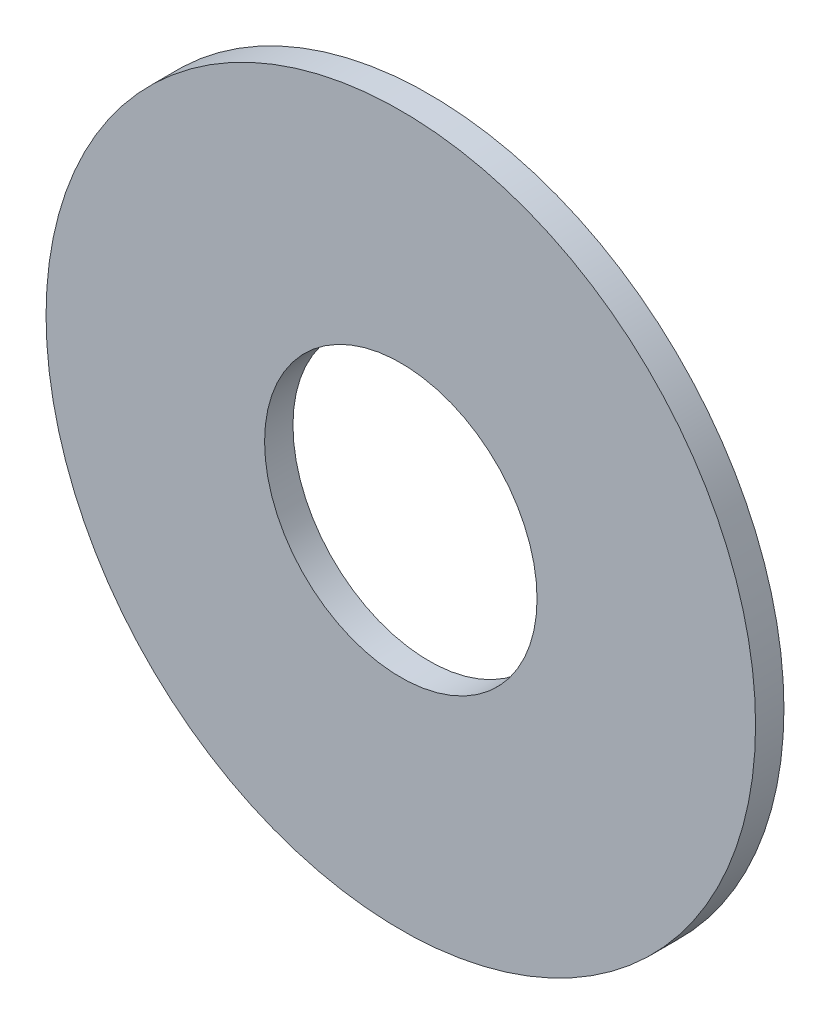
ISO-10303-21;
HEADER;
FILE_DESCRIPTION(('STEP AP214'),'2;1');
FILE_NAME('part.step','',(''),(''),'','','');
FILE_SCHEMA(('AUTOMOTIVE_DESIGN { 1 0 10303 214 1 1 1 1 }'));
ENDSEC;
DATA;
#1=APPLICATION_CONTEXT('core data for automotive mechanical design processes');
#2=APPLICATION_PROTOCOL_DEFINITION('international standard','automotive_design',2000,#1);
#3=PRODUCT_CONTEXT('',#1,'mechanical');
#4=PRODUCT('Part','Part','',(#3));
#5=PRODUCT_RELATED_PRODUCT_CATEGORY('part','',(#4));
#6=PRODUCT_DEFINITION_FORMATION('','',#4);
#7=PRODUCT_DEFINITION_CONTEXT('part definition',#1,'design');
#8=PRODUCT_DEFINITION('design','',#6,#7);
#9=PRODUCT_DEFINITION_SHAPE('','',#8);
#10=(LENGTH_UNIT() NAMED_UNIT(*) SI_UNIT(.MILLI.,.METRE.));
#11=(NAMED_UNIT(*) PLANE_ANGLE_UNIT() SI_UNIT($,.RADIAN.));
#12=(NAMED_UNIT(*) SI_UNIT($,.STERADIAN.) SOLID_ANGLE_UNIT());
#13=UNCERTAINTY_MEASURE_WITH_UNIT(LENGTH_MEASURE(1.E-05),#10,'distance_accuracy_value','');
#14=(GEOMETRIC_REPRESENTATION_CONTEXT(3) GLOBAL_UNCERTAINTY_ASSIGNED_CONTEXT((#13)) GLOBAL_UNIT_ASSIGNED_CONTEXT((#10,
#11,#12)) REPRESENTATION_CONTEXT('',''));
#15=CARTESIAN_POINT('',(0.,0.,0.));
#16=DIRECTION('',(0.,0.,1.));
#17=DIRECTION('',(1.,0.,0.));
#18=AXIS2_PLACEMENT_3D('',#15,#16,#17);
#19=CARTESIAN_POINT('',(0.,0.,0.5));
#20=DIRECTION('',(0.,0.,1.));
#21=DIRECTION('',(1.,0.,0.));
#22=AXIS2_PLACEMENT_3D('',#19,#20,#21);
#23=PLANE('',#22);
#24=CARTESIAN_POINT('',(0.,0.,0.5));
#25=DIRECTION('',(0.,0.,1.));
#26=DIRECTION('',(1.,0.,0.));
#27=AXIS2_PLACEMENT_3D('',#24,#25,#26);
#28=CIRCLE('',#27,6.25);
#29=CARTESIAN_POINT('',(6.25,0.,0.5));
#30=VERTEX_POINT('',#29);
#31=EDGE_CURVE('E10',#30,#30,#28,.T.);
#32=ORIENTED_EDGE('',*,*,#31,.T.);
#33=EDGE_LOOP('',(#32));
#34=FACE_BOUND('',#33,.T.);
#35=CARTESIAN_POINT('',(0.,0.,0.5));
#36=DIRECTION('',(0.,0.,1.));
#37=DIRECTION('',(1.,0.,0.));
#38=AXIS2_PLACEMENT_3D('',#35,#36,#37);
#39=CIRCLE('',#38,2.4);
#40=CARTESIAN_POINT('',(2.4,0.,0.5));
#41=VERTEX_POINT('',#40);
#42=EDGE_CURVE('E44',#41,#41,#39,.T.);
#43=ORIENTED_EDGE('',*,*,#42,.F.);
#44=EDGE_LOOP('',(#43));
#45=FACE_BOUND('',#44,.T.);
#46=ADVANCED_FACE('F33',(#34,#45),#23,.T.);
#47=CARTESIAN_POINT('',(0.,0.,0.));
#48=DIRECTION('',(0.,0.,1.));
#49=DIRECTION('',(1.,0.,0.));
#50=AXIS2_PLACEMENT_3D('',#47,#48,#49);
#51=PLANE('',#50);
#52=CARTESIAN_POINT('',(0.,0.,0.));
#53=DIRECTION('',(0.,0.,1.));
#54=DIRECTION('',(1.,0.,0.));
#55=AXIS2_PLACEMENT_3D('',#52,#53,#54);
#56=CIRCLE('',#55,6.25);
#57=CARTESIAN_POINT('',(6.25,0.,0.));
#58=VERTEX_POINT('',#57);
#59=EDGE_CURVE('E37',#58,#58,#56,.T.);
#60=ORIENTED_EDGE('',*,*,#59,.F.);
#61=EDGE_LOOP('',(#60));
#62=FACE_BOUND('',#61,.T.);
#63=CARTESIAN_POINT('',(0.,0.,0.));
#64=DIRECTION('',(0.,0.,1.));
#65=DIRECTION('',(1.,0.,0.));
#66=AXIS2_PLACEMENT_3D('',#63,#64,#65);
#67=CIRCLE('',#66,2.4);
#68=CARTESIAN_POINT('',(2.4,0.,0.));
#69=VERTEX_POINT('',#68);
#70=EDGE_CURVE('E46',#69,#69,#67,.T.);
#71=ORIENTED_EDGE('',*,*,#70,.T.);
#72=EDGE_LOOP('',(#71));
#73=FACE_BOUND('',#72,.T.);
#74=ADVANCED_FACE('F56',(#62,#73),#51,.F.);
#75=CARTESIAN_POINT('',(0.,0.,0.5));
#76=DIRECTION('',(0.,0.,-1.));
#77=DIRECTION('',(-1.,0.,0.));
#78=AXIS2_PLACEMENT_3D('',#75,#76,#77);
#79=CYLINDRICAL_SURFACE('',#78,6.25);
#80=ORIENTED_EDGE('',*,*,#31,.F.);
#81=EDGE_LOOP('',(#80));
#82=FACE_BOUND('',#81,.T.);
#83=ORIENTED_EDGE('',*,*,#59,.T.);
#84=EDGE_LOOP('',(#83));
#85=FACE_BOUND('',#84,.T.);
#86=ADVANCED_FACE('F35',(#82,#85),#79,.T.);
#87=CARTESIAN_POINT('',(0.,0.,0.5));
#88=DIRECTION('',(0.,0.,-1.));
#89=DIRECTION('',(-1.,0.,0.));
#90=AXIS2_PLACEMENT_3D('',#87,#88,#89);
#91=CYLINDRICAL_SURFACE('',#90,2.4);
#92=ORIENTED_EDGE('',*,*,#42,.T.);
#93=EDGE_LOOP('',(#92));
#94=FACE_BOUND('',#93,.T.);
#95=ORIENTED_EDGE('',*,*,#70,.F.);
#96=EDGE_LOOP('',(#95));
#97=FACE_BOUND('',#96,.T.);
#98=ADVANCED_FACE('F52',(#94,#97),#91,.F.);
#99=CLOSED_SHELL('',(#46,#74,#86,#98));
#100=MANIFOLD_SOLID_BREP('B2',#99);
#101=ADVANCED_BREP_SHAPE_REPRESENTATION('',(#18,#100),#14);
#102=SHAPE_DEFINITION_REPRESENTATION(#9,#101);
ENDSEC;
END-ISO-10303-21;
